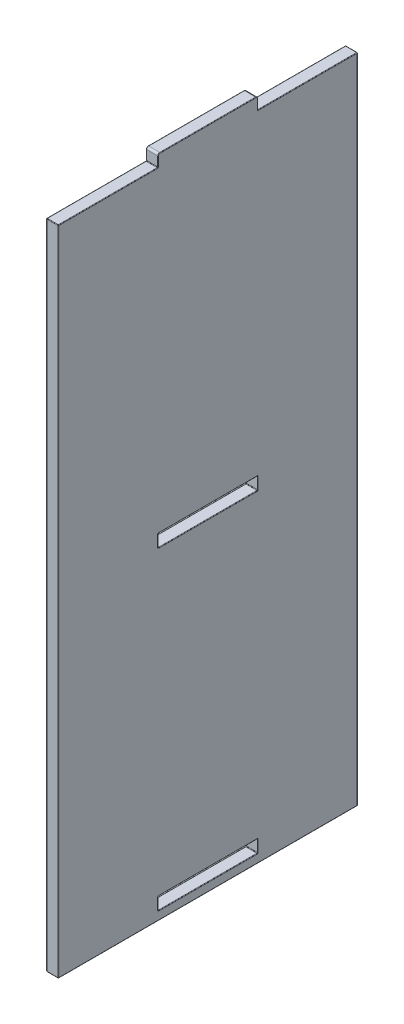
from build123d import *

# Parameters (mm, degrees)
SKETCH1_W           = 100
SKETCH1_H           = 12.5
BOSS_EXTRUDE1_DEPTH = 12
FILLET1_R           = 2
FILLET2_R           = 0.5


with BuildPart() as part:
    # Sketch1 → Boss-Extrude1 (new body)
    with BuildSketch(Plane(origin=(0, 0, 0), x_dir=(0, 0, -1), z_dir=(1, 0, 0))):
        Polygon((-150, 327), (-50, 327), (-50, 339), (50, 339), (50, 327), (150, 327), (150, -327), (-150, -327), align=None)
        with Locations((0, 3)):
            Rectangle(SKETCH1_W, SKETCH1_H, mode=Mode.SUBTRACT)
        with Locations((0, -312)):
            Rectangle(SKETCH1_W, SKETCH1_H, mode=Mode.SUBTRACT)
    extrude(amount=BOSS_EXTRUDE1_DEPTH)

    # Fillet1
    fillet1_edges = [part.edges().sort_by_distance(p)[0] for p in [
        (6, 339, 50),
        (6, 339, -50),
    ]]
    fillet(fillet1_edges, radius=FILLET1_R)

    # Fillet2
    fillet2_edges = [part.edges().sort_by_distance(p)[0] for p in [
        (12, 332, -50),
        (0, 327, -100),
        (0, 332, 50),
        (0, 338.414213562, 49.414213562),
        (0, 338.414213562, -49.414213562),
        (12, 332, 50),
        (12, 338.414213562, 49.414213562),
        (12, 338.414213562, -49.414213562),
        (0, 0, -150),
        (6, -327, -150),
        (6, -327, 150),
        (6, 327, 150),
        (6, 327, 50),
        (6, 327, -50),
        (6, 327, -150),
        (12, 327, 100),
        (12, 0, 150),
        (0, 3, -50),
        (6, -3.25, -50),
        (0, 9.25, 0),
        (6, 9.25, -50),
        (0, 3, 50),
        (6, 9.25, 50),
        (0, -3.25, 0),
        (12, -327, 0),
        (6, -3.25, 50),
        (12, 3, -50),
        (12, 9.25, 0),
        (12, 3, 50),
        (12, -3.25, 0),
        (0, -312, -50),
        (6, -318.25, -50),
        (0, -305.75, 0),
        (6, -305.75, -50),
        (0, -312, 50),
        (6, -305.75, 50),
        (0, -318.25, 0),
        (6, -318.25, 50),
        (12, -312, -50),
        (12, -305.75, 0),
        (12, -312, 50),
        (12, -318.25, 0),
        (12, 0, -150),
        (12, 327, -100),
        (0, -327, 0),
        (0, 0, 150),
        (0, 327, 100),
        (0, 332, -50),
        (0, 339, 0),
        (12, 339, 0),
    ]]
    fillet(fillet2_edges, radius=FILLET2_R)


solid = part.part
